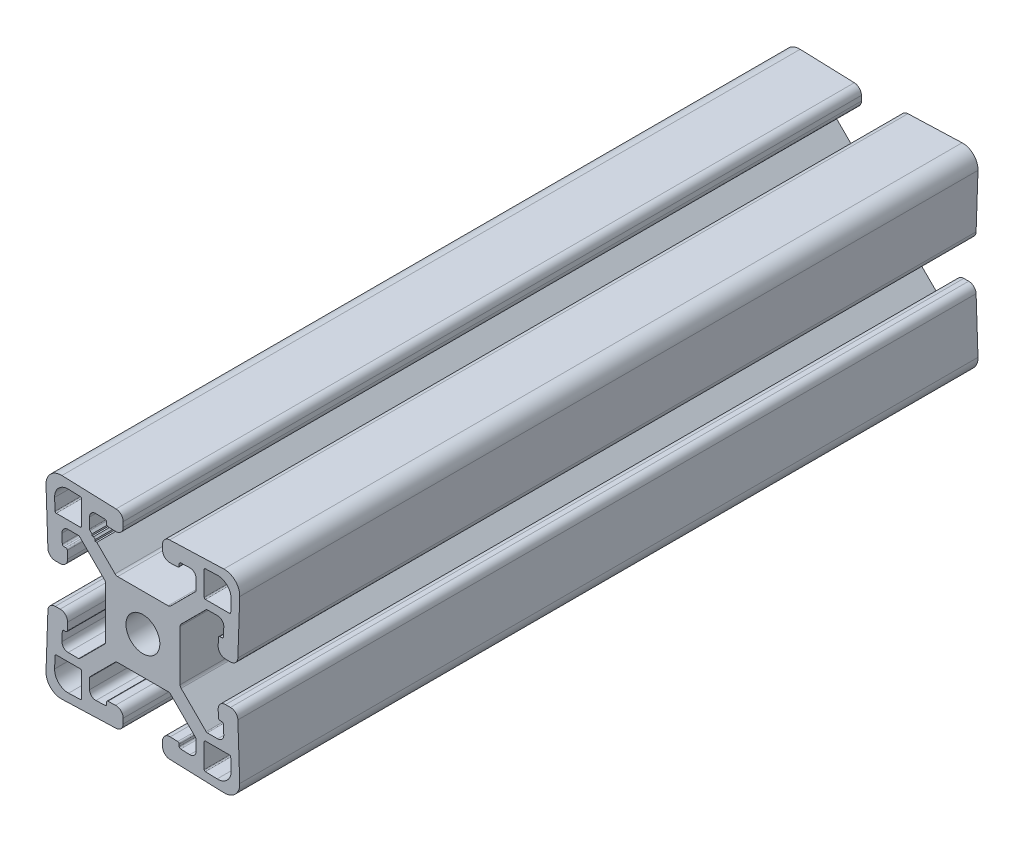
from build123d import *

# Parameters (mm, degrees)
BOSS_EXTRUDE1_DEPTH     = 76.2
CIRPATTERN1_COUNT       = 4
CUT_EXTRUDE1_DEPTH      = 82.280009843
CUT_EXTRUDE1_DEPTH_BACK = 82.280009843


with BuildPart() as part:
    # Sketch3 → Boss-Extrude1 (new, symmetric)
    with BuildSketch(Plane.XY):
        with BuildLine():
            Line((-7.681, 0), (-7.681, 5.210107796))
            ThreePointArc((-7.681, 5.210107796), (-7.739003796, 5.501712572), (-7.904184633, 5.748923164))
            Line((-7.904184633, 5.748923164), (-13.062267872, 10.907006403))
            ThreePointArc((-13.062267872, 10.907006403), (-13.165272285, 10.975831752), (-13.286774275, 11))
            Line((-13.286774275, 11), (-15.433540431, 11))
            ThreePointArc((-15.433540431, 11), (-16.347101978, 10.61221613), (-16.702766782, 9.685677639))
            Line((-16.702766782, 9.685677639), (-16.637141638, 7.80641941))
            ThreePointArc((-16.637141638, 7.80641941), (-16.540389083, 7.589109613), (-16.319835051, 7.5))
            Line((-16.319835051, 7.5), (-15.916428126, 7.5))
            ThreePointArc((-15.916428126, 7.5), (-15.695874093, 7.410890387), (-15.599121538, 7.19358059))
            Line((-15.599121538, 7.19358059), (-15.544946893, 5.642221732))
            ThreePointArc((-15.544946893, 5.642221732), (-15.972024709, 4.529645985), (-17.069017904, 4.064))
            Line((-17.069017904, 4.064), (-18.083635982, 4.064))
            ThreePointArc((-18.083635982, 4.064), (-19.142989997, 4.492006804), (-19.607706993, 5.535778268))
            Line((-19.607706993, 5.535778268), (-19.998065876, 16.714194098))
            ThreePointArc((-19.998065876, 16.714194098), (-19.07006403, 19.07006403), (-16.714194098, 19.998065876))
            Line((-16.714194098, 19.998065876), (-5.535778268, 19.607706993))
            ThreePointArc((-5.535778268, 19.607706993), (-4.492006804, 19.142989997), (-4.064, 18.083635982))
            Line((-4.064, 18.083635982), (-4.064, 17.069017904))
            ThreePointArc((-4.064, 17.069017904), (-4.529645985, 15.972024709), (-5.642221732, 15.544946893))
            Line((-5.642221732, 15.544946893), (-7.19358059, 15.599121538))
            ThreePointArc((-7.19358059, 15.599121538), (-7.410890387, 15.695874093), (-7.5, 15.916428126))
            Line((-7.5, 15.916428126), (-7.5, 16.319835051))
            ThreePointArc((-7.5, 16.319835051), (-7.589109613, 16.540389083), (-7.80641941, 16.637141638))
            Line((-7.80641941, 16.637141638), (-9.685677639, 16.702766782))
            ThreePointArc((-9.685677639, 16.702766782), (-10.61221613, 16.347101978), (-11, 15.433540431))
            Line((-11, 15.433540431), (-11, 13.286774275))
            ThreePointArc((-11, 13.286774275), (-10.975831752, 13.165272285), (-10.907006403, 13.062267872))
            Line((-10.907006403, 13.062267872), (-5.748923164, 7.904184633))
            ThreePointArc((-5.748923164, 7.904184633), (-5.501712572, 7.739003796), (-5.210107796, 7.681))
            Line((-5.210107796, 7.681), (0, 7.681))
            Line((0, 7.681), (0, 3.5))
            ThreePointArc((0, 3.5), (-2.474873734, 2.474873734), (-3.5, 0))
            Line((-3.5, 0), (-7.681, 0))
        make_face()
        with BuildLine():
            Line((-18.220706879, 15.330899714), (-18.136032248, 12.906135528))
            ThreePointArc((-18.136032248, 12.906135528), (-18.058630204, 12.732287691), (-17.882186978, 12.661))
            Line((-17.882186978, 12.661), (-12.915, 12.661))
            ThreePointArc((-12.915, 12.661), (-12.735394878, 12.735394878), (-12.661, 12.915))
            Line((-12.661, 12.915), (-12.661, 17.882186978))
            ThreePointArc((-12.661, 17.882186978), (-12.732287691, 18.058630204), (-12.906135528, 18.136032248))
            Line((-12.906135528, 18.136032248), (-15.330899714, 18.220706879))
            ThreePointArc((-15.330899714, 18.220706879), (-17.404065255, 17.404065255), (-18.220706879, 15.330899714))
        make_face(mode=Mode.SUBTRACT)
    boss_extrude1 = extrude(amount=BOSS_EXTRUDE1_DEPTH, both=True)

    # CirPattern1: Boss-Extrude1 ×4 about axis
    cirpattern1_axis = Axis((0, 0, 0), (0, 0, 1))
    for i in range(1, CIRPATTERN1_COUNT):
        add(boss_extrude1.rotate(cirpattern1_axis, i * 360 / CIRPATTERN1_COUNT))

    # Sketch4 → Cut-Extrude1 (cut, two sides: drawn at the far end of the back side and taken through both)
    with BuildSketch(Plane.XY.offset(-CUT_EXTRUDE1_DEPTH_BACK)):
        Polygon((-10.505738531, 12.661), (-9.505738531, 12.661), (-9.505738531, 11.661), (-9.839071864, 11.661), (-9.839071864, 11.994333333), (-10.172405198, 12.327666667), (-10.505738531, 12.327666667), align=None)
    extrude(amount=CUT_EXTRUDE1_DEPTH + CUT_EXTRUDE1_DEPTH_BACK, mode=Mode.SUBTRACT)


solid = part.part
